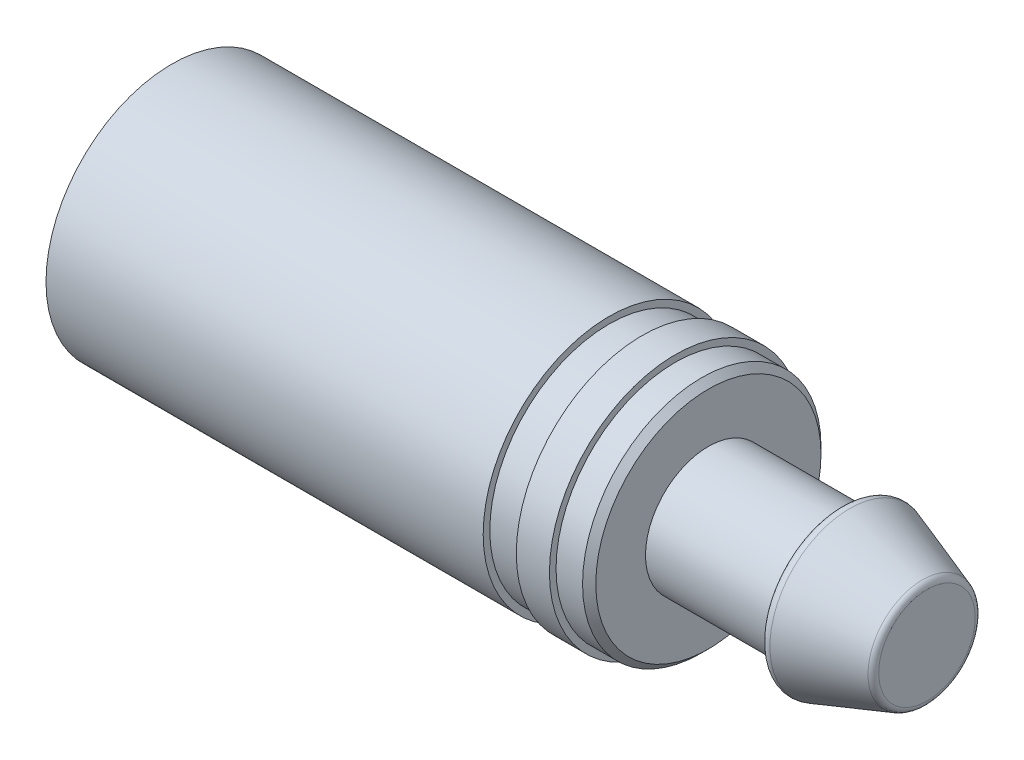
from build123d import *

# Parameters (mm, degrees)
REDONDEO1_R   = 1
CHAFL_N1_SIZE = 1


with BuildPart() as part:
    # Croquis1 → Revoluci_n1 (revolve)
    with BuildSketch(Plane.XY, mode=Mode.PRIVATE) as revoluci_n1_sk:
        Polygon((0, 0), (0, 19), (66, 19), (66, 18), (71, 18), (71, 19), (76, 19), (76, 18), (81, 18), (81, 9.5), (101, 9.5), (101, 12.5), (114, 8), (114, 0), align=None)
    revolve(revoluci_n1_sk.sketch.rotate(Axis((0, 0, 0), (1, 0, 0)), 90), axis=Axis((0, 0, 0), (1, 0, 0)))

    # Redondeo1
    redondeo1_edges = [part.edges().sort_by_distance(p)[0] for p in [
        (101, 0, -12.5),
        (114, 0, -8),
    ]]
    fillet(redondeo1_edges, radius=REDONDEO1_R)

    # Chafl_n1
    chafl_n1_edges = [part.edges().sort_by_distance(p)[0] for p in [
        (81, 0, -18),
    ]]
    chamfer(chafl_n1_edges, length=CHAFL_N1_SIZE)


solid = part.part
